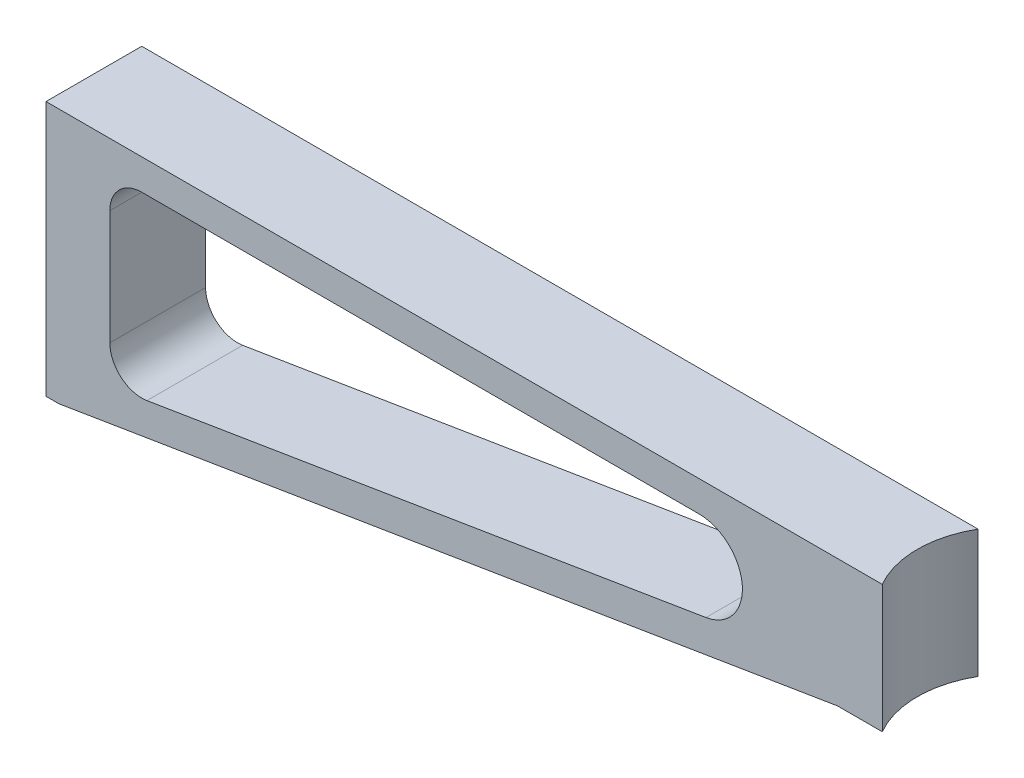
ISO-10303-21;
HEADER;
FILE_DESCRIPTION(('STEP AP214'),'2;1');
FILE_NAME('part.step','',(''),(''),'','','');
FILE_SCHEMA(('AUTOMOTIVE_DESIGN { 1 0 10303 214 1 1 1 1 }'));
ENDSEC;
DATA;
#1=APPLICATION_CONTEXT('core data for automotive mechanical design processes');
#2=APPLICATION_PROTOCOL_DEFINITION('international standard','automotive_design',2000,#1);
#3=PRODUCT_CONTEXT('',#1,'mechanical');
#4=PRODUCT('Part','Part','',(#3));
#5=PRODUCT_RELATED_PRODUCT_CATEGORY('part','',(#4));
#6=PRODUCT_DEFINITION_FORMATION('','',#4);
#7=PRODUCT_DEFINITION_CONTEXT('part definition',#1,'design');
#8=PRODUCT_DEFINITION('design','',#6,#7);
#9=PRODUCT_DEFINITION_SHAPE('','',#8);
#10=(LENGTH_UNIT() NAMED_UNIT(*) SI_UNIT(.MILLI.,.METRE.));
#11=(NAMED_UNIT(*) PLANE_ANGLE_UNIT() SI_UNIT($,.RADIAN.));
#12=(NAMED_UNIT(*) SI_UNIT($,.STERADIAN.) SOLID_ANGLE_UNIT());
#13=UNCERTAINTY_MEASURE_WITH_UNIT(LENGTH_MEASURE(1.E-05),#10,'distance_accuracy_value','');
#14=(GEOMETRIC_REPRESENTATION_CONTEXT(3) GLOBAL_UNCERTAINTY_ASSIGNED_CONTEXT((#13)) GLOBAL_UNIT_ASSIGNED_CONTEXT((#10,
#11,#12)) REPRESENTATION_CONTEXT('',''));
#15=CARTESIAN_POINT('',(0.,0.,0.));
#16=DIRECTION('',(0.,0.,1.));
#17=DIRECTION('',(1.,0.,0.));
#18=AXIS2_PLACEMENT_3D('',#15,#16,#17);
#19=CARTESIAN_POINT('',(0.,0.,4.7625));
#20=DIRECTION('',(0.,0.,1.));
#21=DIRECTION('',(1.,0.,0.));
#22=AXIS2_PLACEMENT_3D('',#19,#20,#21);
#23=PLANE('',#22);
#24=DIRECTION('',(0.,1.,0.));
#25=VECTOR('',#24,1.);
#26=CARTESIAN_POINT('',(-8.24889197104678,-25.4,4.7625));
#27=LINE('',#26,#25);
#28=CARTESIAN_POINT('',(-8.24889197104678,0.,4.7625));
#29=VERTEX_POINT('',#28);
#30=CARTESIAN_POINT('',(-8.24889197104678,-12.7,4.7625));
#31=VERTEX_POINT('',#30);
#32=EDGE_CURVE('E124',#29,#31,#27,.F.);
#33=ORIENTED_EDGE('',*,*,#32,.F.);
#34=DIRECTION('',(-1.,0.,0.));
#35=VECTOR('',#34,1.);
#36=CARTESIAN_POINT('',(0.,0.,4.7625));
#37=LINE('',#36,#35);
#38=CARTESIAN_POINT('',(-91.44,0.,4.7625));
#39=VERTEX_POINT('',#38);
#40=EDGE_CURVE('E132',#29,#39,#37,.T.);
#41=ORIENTED_EDGE('',*,*,#40,.T.);
#42=DIRECTION('',(0.,-1.,0.));
#43=VECTOR('',#42,1.);
#44=CARTESIAN_POINT('',(-91.44,0.,4.7625));
#45=LINE('',#44,#43);
#46=CARTESIAN_POINT('',(-91.44,-25.4,4.7625));
#47=VERTEX_POINT('',#46);
#48=EDGE_CURVE('E142',#39,#47,#45,.T.);
#49=ORIENTED_EDGE('',*,*,#48,.T.);
#50=DIRECTION('',(1.,0.,0.));
#51=VECTOR('',#50,1.);
#52=CARTESIAN_POINT('',(-91.44,-25.4,4.7625));
#53=LINE('',#52,#51);
#54=CARTESIAN_POINT('',(-90.17,-25.4,4.7625));
#55=VERTEX_POINT('',#54);
#56=EDGE_CURVE('E163',#47,#55,#53,.T.);
#57=ORIENTED_EDGE('',*,*,#56,.T.);
#58=DIRECTION('',(0.986827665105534,0.161775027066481,0.));
#59=VECTOR('',#58,1.);
#60=CARTESIAN_POINT('',(-12.7,-12.7,4.7625));
#61=LINE('',#60,#59);
#62=CARTESIAN_POINT('',(-12.7,-12.7,4.7625));
#63=VERTEX_POINT('',#62);
#64=EDGE_CURVE('E146',#55,#63,#61,.T.);
#65=ORIENTED_EDGE('',*,*,#64,.T.);
#66=DIRECTION('',(1.,0.,0.));
#67=VECTOR('',#66,1.);
#68=CARTESIAN_POINT('',(-12.7,-12.7,4.7625));
#69=LINE('',#68,#67);
#70=EDGE_CURVE('E135',#63,#31,#69,.T.);
#71=ORIENTED_EDGE('',*,*,#70,.T.);
#72=EDGE_LOOP('',(#33,#41,#49,#57,#65,#71));
#73=FACE_BOUND('',#72,.T.);
#74=DIRECTION('',(0.,-1.,0.));
#75=VECTOR('',#74,1.);
#76=CARTESIAN_POINT('',(-85.09,-6.22300000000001,4.7625));
#77=LINE('',#76,#75);
#78=CARTESIAN_POINT('',(-85.09,-6.22300000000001,4.7625));
#79=VERTEX_POINT('',#78);
#80=CARTESIAN_POINT('',(-85.0899999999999,-17.6119604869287,4.7625));
#81=VERTEX_POINT('',#80);
#82=EDGE_CURVE('E192',#79,#81,#77,.T.);
#83=ORIENTED_EDGE('',*,*,#82,.F.);
#84=CARTESIAN_POINT('',(-81.915,-6.22300000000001,4.7625));
#85=DIRECTION('',(0.,0.,1.));
#86=DIRECTION('',(-1.,0.,0.));
#87=AXIS2_PLACEMENT_3D('',#84,#85,#86);
#88=CIRCLE('',#87,3.175);
#89=CARTESIAN_POINT('',(-81.915,-3.04800000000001,4.7625));
#90=VERTEX_POINT('',#89);
#91=EDGE_CURVE('E190',#90,#79,#88,.T.);
#92=ORIENTED_EDGE('',*,*,#91,.F.);
#93=DIRECTION('',(-1.,0.,0.));
#94=VECTOR('',#93,1.);
#95=CARTESIAN_POINT('',(-26.4800084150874,-3.048,4.7625));
#96=LINE('',#95,#94);
#97=CARTESIAN_POINT('',(-26.4800084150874,-3.048,4.7625));
#98=VERTEX_POINT('',#97);
#99=EDGE_CURVE('E201',#98,#90,#96,.T.);
#100=ORIENTED_EDGE('',*,*,#99,.F.);
#101=CARTESIAN_POINT('',(-26.4800084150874,-7.366,4.7625));
#102=DIRECTION('',(0.,0.,1.));
#103=DIRECTION('',(1.,0.,0.));
#104=AXIS2_PLACEMENT_3D('',#101,#102,#103);
#105=CIRCLE('',#104,4.318);
#106=CARTESIAN_POINT('',(-25.7814638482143,-11.6271218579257,4.7625));
#107=VERTEX_POINT('',#106);
#108=EDGE_CURVE('E199',#107,#98,#105,.T.);
#109=ORIENTED_EDGE('',*,*,#108,.F.);
#110=DIRECTION('',(0.986827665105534,0.161775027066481,0.));
#111=VECTOR('',#110,1.);
#112=CARTESIAN_POINT('',(-81.4013642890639,-20.7451383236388,4.7625));
#113=LINE('',#112,#111);
#114=CARTESIAN_POINT('',(-81.4013642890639,-20.7451383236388,4.7625));
#115=VERTEX_POINT('',#114);
#116=EDGE_CURVE('E197',#115,#107,#113,.T.);
#117=ORIENTED_EDGE('',*,*,#116,.F.);
#118=CARTESIAN_POINT('',(-81.915,-17.6119604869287,4.7625));
#119=DIRECTION('',(0.,0.,1.));
#120=DIRECTION('',(1.,0.,0.));
#121=AXIS2_PLACEMENT_3D('',#118,#119,#120);
#122=CIRCLE('',#121,3.17499999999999);
#123=EDGE_CURVE('E195',#81,#115,#122,.T.);
#124=ORIENTED_EDGE('',*,*,#123,.F.);
#125=EDGE_LOOP('',(#83,#92,#100,#109,#117,#124));
#126=FACE_BOUND('',#125,.T.);
#127=ADVANCED_FACE('F37',(#73,#126),#23,.T.);
#128=CARTESIAN_POINT('',(0.,0.,-4.7625));
#129=DIRECTION('',(0.,0.,1.));
#130=DIRECTION('',(1.,0.,0.));
#131=AXIS2_PLACEMENT_3D('',#128,#129,#130);
#132=PLANE('',#131);
#133=DIRECTION('',(-1.,0.,0.));
#134=VECTOR('',#133,1.);
#135=CARTESIAN_POINT('',(0.,0.,-4.7625));
#136=LINE('',#135,#134);
#137=CARTESIAN_POINT('',(-8.24889197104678,0.,-4.7625));
#138=VERTEX_POINT('',#137);
#139=CARTESIAN_POINT('',(-91.44,0.,-4.7625));
#140=VERTEX_POINT('',#139);
#141=EDGE_CURVE('E159',#138,#140,#136,.T.);
#142=ORIENTED_EDGE('',*,*,#141,.F.);
#143=DIRECTION('',(0.,1.,0.));
#144=VECTOR('',#143,1.);
#145=CARTESIAN_POINT('',(-8.24889197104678,-25.4,-4.7625));
#146=LINE('',#145,#144);
#147=CARTESIAN_POINT('',(-8.24889197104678,-12.7,-4.7625));
#148=VERTEX_POINT('',#147);
#149=EDGE_CURVE('E52',#138,#148,#146,.F.);
#150=ORIENTED_EDGE('',*,*,#149,.T.);
#151=DIRECTION('',(1.,0.,0.));
#152=VECTOR('',#151,1.);
#153=CARTESIAN_POINT('',(-12.7,-12.7,-4.7625));
#154=LINE('',#153,#152);
#155=CARTESIAN_POINT('',(-12.7,-12.7,-4.7625));
#156=VERTEX_POINT('',#155);
#157=EDGE_CURVE('E156',#156,#148,#154,.T.);
#158=ORIENTED_EDGE('',*,*,#157,.F.);
#159=DIRECTION('',(0.986827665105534,0.161775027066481,0.));
#160=VECTOR('',#159,1.);
#161=CARTESIAN_POINT('',(-12.7,-12.7,-4.7625));
#162=LINE('',#161,#160);
#163=CARTESIAN_POINT('',(-90.17,-25.4,-4.7625));
#164=VERTEX_POINT('',#163);
#165=EDGE_CURVE('E153',#164,#156,#162,.T.);
#166=ORIENTED_EDGE('',*,*,#165,.F.);
#167=DIRECTION('',(1.,0.,0.));
#168=VECTOR('',#167,1.);
#169=CARTESIAN_POINT('',(-91.44,-25.4,-4.7625));
#170=LINE('',#169,#168);
#171=CARTESIAN_POINT('',(-91.44,-25.4,-4.7625));
#172=VERTEX_POINT('',#171);
#173=EDGE_CURVE('E150',#172,#164,#170,.T.);
#174=ORIENTED_EDGE('',*,*,#173,.F.);
#175=DIRECTION('',(0.,-1.,0.));
#176=VECTOR('',#175,1.);
#177=CARTESIAN_POINT('',(-91.44,0.,-4.7625));
#178=LINE('',#177,#176);
#179=EDGE_CURVE('E161',#140,#172,#178,.T.);
#180=ORIENTED_EDGE('',*,*,#179,.F.);
#181=EDGE_LOOP('',(#142,#150,#158,#166,#174,#180));
#182=FACE_BOUND('',#181,.T.);
#183=CARTESIAN_POINT('',(-81.915,-6.22300000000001,-4.7625));
#184=DIRECTION('',(0.,0.,1.));
#185=DIRECTION('',(-1.,0.,0.));
#186=AXIS2_PLACEMENT_3D('',#183,#184,#185);
#187=CIRCLE('',#186,3.175);
#188=CARTESIAN_POINT('',(-81.915,-3.04800000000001,-4.7625));
#189=VERTEX_POINT('',#188);
#190=CARTESIAN_POINT('',(-85.09,-6.22300000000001,-4.7625));
#191=VERTEX_POINT('',#190);
#192=EDGE_CURVE('E136',#189,#191,#187,.T.);
#193=ORIENTED_EDGE('',*,*,#192,.T.);
#194=DIRECTION('',(0.,-1.,0.));
#195=VECTOR('',#194,1.);
#196=CARTESIAN_POINT('',(-85.09,-6.22300000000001,-4.7625));
#197=LINE('',#196,#195);
#198=CARTESIAN_POINT('',(-85.0899999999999,-17.6119604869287,-4.7625));
#199=VERTEX_POINT('',#198);
#200=EDGE_CURVE('E206',#191,#199,#197,.T.);
#201=ORIENTED_EDGE('',*,*,#200,.T.);
#202=CARTESIAN_POINT('',(-81.915,-17.6119604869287,-4.7625));
#203=DIRECTION('',(0.,0.,1.));
#204=DIRECTION('',(1.,0.,0.));
#205=AXIS2_PLACEMENT_3D('',#202,#203,#204);
#206=CIRCLE('',#205,3.17499999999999);
#207=CARTESIAN_POINT('',(-81.4013642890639,-20.7451383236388,-4.7625));
#208=VERTEX_POINT('',#207);
#209=EDGE_CURVE('E209',#199,#208,#206,.T.);
#210=ORIENTED_EDGE('',*,*,#209,.T.);
#211=DIRECTION('',(0.986827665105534,0.161775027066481,0.));
#212=VECTOR('',#211,1.);
#213=CARTESIAN_POINT('',(-81.4013642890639,-20.7451383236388,-4.7625));
#214=LINE('',#213,#212);
#215=CARTESIAN_POINT('',(-25.7814638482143,-11.6271218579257,-4.7625));
#216=VERTEX_POINT('',#215);
#217=EDGE_CURVE('E212',#208,#216,#214,.T.);
#218=ORIENTED_EDGE('',*,*,#217,.T.);
#219=CARTESIAN_POINT('',(-26.4800084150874,-7.366,-4.7625));
#220=DIRECTION('',(0.,0.,1.));
#221=DIRECTION('',(1.,0.,0.));
#222=AXIS2_PLACEMENT_3D('',#219,#220,#221);
#223=CIRCLE('',#222,4.318);
#224=CARTESIAN_POINT('',(-26.4800084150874,-3.048,-4.7625));
#225=VERTEX_POINT('',#224);
#226=EDGE_CURVE('E215',#216,#225,#223,.T.);
#227=ORIENTED_EDGE('',*,*,#226,.T.);
#228=DIRECTION('',(-1.,0.,0.));
#229=VECTOR('',#228,1.);
#230=CARTESIAN_POINT('',(-26.4800084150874,-3.048,-4.7625));
#231=LINE('',#230,#229);
#232=EDGE_CURVE('E193',#225,#189,#231,.T.);
#233=ORIENTED_EDGE('',*,*,#232,.T.);
#234=EDGE_LOOP('',(#193,#201,#210,#218,#227,#233));
#235=FACE_BOUND('',#234,.T.);
#236=ADVANCED_FACE('F181',(#182,#235),#132,.F.);
#237=CARTESIAN_POINT('',(-91.44,-25.4,4.7625));
#238=DIRECTION('',(0.,1.,0.));
#239=DIRECTION('',(0.,0.,1.));
#240=AXIS2_PLACEMENT_3D('',#237,#238,#239);
#241=PLANE('',#240);
#242=ORIENTED_EDGE('',*,*,#173,.T.);
#243=DIRECTION('',(0.,0.,-1.));
#244=VECTOR('',#243,1.);
#245=CARTESIAN_POINT('',(-90.17,-25.4,4.7625));
#246=LINE('',#245,#244);
#247=EDGE_CURVE('E45',#55,#164,#246,.T.);
#248=ORIENTED_EDGE('',*,*,#247,.F.);
#249=ORIENTED_EDGE('',*,*,#56,.F.);
#250=DIRECTION('',(0.,0.,-1.));
#251=VECTOR('',#250,1.);
#252=CARTESIAN_POINT('',(-91.44,-25.4,4.7625));
#253=LINE('',#252,#251);
#254=EDGE_CURVE('E144',#47,#172,#253,.T.);
#255=ORIENTED_EDGE('',*,*,#254,.T.);
#256=EDGE_LOOP('',(#242,#248,#249,#255));
#257=FACE_BOUND('',#256,.T.);
#258=ADVANCED_FACE('F39',(#257),#241,.F.);
#259=CARTESIAN_POINT('',(-12.7,-12.7,4.7625));
#260=DIRECTION('',(-0.161775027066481,0.986827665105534,0.));
#261=DIRECTION('',(-0.986827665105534,-0.161775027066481,0.));
#262=AXIS2_PLACEMENT_3D('',#259,#260,#261);
#263=PLANE('',#262);
#264=ORIENTED_EDGE('',*,*,#165,.T.);
#265=DIRECTION('',(0.,0.,-1.));
#266=VECTOR('',#265,1.);
#267=CARTESIAN_POINT('',(-12.7,-12.7,4.7625));
#268=LINE('',#267,#266);
#269=EDGE_CURVE('E167',#63,#156,#268,.T.);
#270=ORIENTED_EDGE('',*,*,#269,.F.);
#271=ORIENTED_EDGE('',*,*,#64,.F.);
#272=ORIENTED_EDGE('',*,*,#247,.T.);
#273=EDGE_LOOP('',(#264,#270,#271,#272));
#274=FACE_BOUND('',#273,.T.);
#275=ADVANCED_FACE('F172',(#274),#263,.F.);
#276=CARTESIAN_POINT('',(-12.7,-12.7,4.7625));
#277=DIRECTION('',(0.,1.,0.));
#278=DIRECTION('',(0.,0.,1.));
#279=AXIS2_PLACEMENT_3D('',#276,#277,#278);
#280=PLANE('',#279);
#281=ORIENTED_EDGE('',*,*,#157,.T.);
#282=CARTESIAN_POINT('',(0.,-12.7,0.));
#283=DIRECTION('',(0.,1.,0.));
#284=DIRECTION('',(0.,0.,1.));
#285=AXIS2_PLACEMENT_3D('',#282,#283,#284);
#286=CIRCLE('',#285,9.525);
#287=EDGE_CURVE('E186',#148,#31,#286,.T.);
#288=ORIENTED_EDGE('',*,*,#287,.T.);
#289=ORIENTED_EDGE('',*,*,#70,.F.);
#290=ORIENTED_EDGE('',*,*,#269,.T.);
#291=EDGE_LOOP('',(#281,#288,#289,#290));
#292=FACE_BOUND('',#291,.T.);
#293=ADVANCED_FACE('F185',(#292),#280,.F.);
#294=CARTESIAN_POINT('',(0.,0.,4.7625));
#295=DIRECTION('',(0.,-1.,0.));
#296=DIRECTION('',(1.,0.,0.));
#297=AXIS2_PLACEMENT_3D('',#294,#295,#296);
#298=PLANE('',#297);
#299=ORIENTED_EDGE('',*,*,#40,.F.);
#300=CARTESIAN_POINT('',(0.,0.,0.));
#301=DIRECTION('',(0.,-1.,0.));
#302=DIRECTION('',(1.,0.,0.));
#303=AXIS2_PLACEMENT_3D('',#300,#301,#302);
#304=CIRCLE('',#303,9.525);
#305=EDGE_CURVE('E11',#29,#138,#304,.T.);
#306=ORIENTED_EDGE('',*,*,#305,.T.);
#307=ORIENTED_EDGE('',*,*,#141,.T.);
#308=DIRECTION('',(0.,0.,-1.));
#309=VECTOR('',#308,1.);
#310=CARTESIAN_POINT('',(-91.44,0.,4.7625));
#311=LINE('',#310,#309);
#312=EDGE_CURVE('E140',#39,#140,#311,.T.);
#313=ORIENTED_EDGE('',*,*,#312,.F.);
#314=EDGE_LOOP('',(#299,#306,#307,#313));
#315=FACE_BOUND('',#314,.T.);
#316=ADVANCED_FACE('F138',(#315),#298,.F.);
#317=CARTESIAN_POINT('',(-91.44,0.,4.7625));
#318=DIRECTION('',(1.,0.,0.));
#319=DIRECTION('',(0.,0.,-1.));
#320=AXIS2_PLACEMENT_3D('',#317,#318,#319);
#321=PLANE('',#320);
#322=ORIENTED_EDGE('',*,*,#179,.T.);
#323=ORIENTED_EDGE('',*,*,#254,.F.);
#324=ORIENTED_EDGE('',*,*,#48,.F.);
#325=ORIENTED_EDGE('',*,*,#312,.T.);
#326=EDGE_LOOP('',(#322,#323,#324,#325));
#327=FACE_BOUND('',#326,.T.);
#328=ADVANCED_FACE('F232',(#327),#321,.F.);
#329=CARTESIAN_POINT('',(-81.915,-6.22300000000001,4.7625));
#330=DIRECTION('',(0.,0.,-1.));
#331=DIRECTION('',(-1.,0.,0.));
#332=AXIS2_PLACEMENT_3D('',#329,#330,#331);
#333=CYLINDRICAL_SURFACE('',#332,3.175);
#334=ORIENTED_EDGE('',*,*,#192,.F.);
#335=DIRECTION('',(0.,0.,-1.));
#336=VECTOR('',#335,1.);
#337=CARTESIAN_POINT('',(-81.915,-3.04800000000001,4.7625));
#338=LINE('',#337,#336);
#339=EDGE_CURVE('E203',#90,#189,#338,.T.);
#340=ORIENTED_EDGE('',*,*,#339,.F.);
#341=ORIENTED_EDGE('',*,*,#91,.T.);
#342=DIRECTION('',(0.,0.,-1.));
#343=VECTOR('',#342,1.);
#344=CARTESIAN_POINT('',(-85.09,-6.22300000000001,4.7625));
#345=LINE('',#344,#343);
#346=EDGE_CURVE('E154',#79,#191,#345,.T.);
#347=ORIENTED_EDGE('',*,*,#346,.T.);
#348=EDGE_LOOP('',(#334,#340,#341,#347));
#349=FACE_BOUND('',#348,.T.);
#350=ADVANCED_FACE('F234',(#349),#333,.F.);
#351=CARTESIAN_POINT('',(-85.09,-6.22300000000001,4.7625));
#352=DIRECTION('',(1.,0.,0.));
#353=DIRECTION('',(0.,1.,0.));
#354=AXIS2_PLACEMENT_3D('',#351,#352,#353);
#355=PLANE('',#354);
#356=ORIENTED_EDGE('',*,*,#200,.F.);
#357=ORIENTED_EDGE('',*,*,#346,.F.);
#358=ORIENTED_EDGE('',*,*,#82,.T.);
#359=DIRECTION('',(0.,0.,-1.));
#360=VECTOR('',#359,1.);
#361=CARTESIAN_POINT('',(-85.0899999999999,-17.6119604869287,4.7625));
#362=LINE('',#361,#360);
#363=EDGE_CURVE('E227',#81,#199,#362,.T.);
#364=ORIENTED_EDGE('',*,*,#363,.T.);
#365=EDGE_LOOP('',(#356,#357,#358,#364));
#366=FACE_BOUND('',#365,.T.);
#367=ADVANCED_FACE('F240',(#366),#355,.T.);
#368=CARTESIAN_POINT('',(-81.915,-17.6119604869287,4.7625));
#369=DIRECTION('',(0.,0.,-1.));
#370=DIRECTION('',(-1.,0.,0.));
#371=AXIS2_PLACEMENT_3D('',#368,#369,#370);
#372=CYLINDRICAL_SURFACE('',#371,3.17499999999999);
#373=ORIENTED_EDGE('',*,*,#209,.F.);
#374=ORIENTED_EDGE('',*,*,#363,.F.);
#375=ORIENTED_EDGE('',*,*,#123,.T.);
#376=DIRECTION('',(0.,0.,-1.));
#377=VECTOR('',#376,1.);
#378=CARTESIAN_POINT('',(-81.4013642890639,-20.7451383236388,4.7625));
#379=LINE('',#378,#377);
#380=EDGE_CURVE('E225',#115,#208,#379,.T.);
#381=ORIENTED_EDGE('',*,*,#380,.T.);
#382=EDGE_LOOP('',(#373,#374,#375,#381));
#383=FACE_BOUND('',#382,.T.);
#384=ADVANCED_FACE('F253',(#383),#372,.F.);
#385=CARTESIAN_POINT('',(-81.4013642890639,-20.7451383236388,4.7625));
#386=DIRECTION('',(-0.161775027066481,0.986827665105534,0.));
#387=DIRECTION('',(-0.986827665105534,-0.161775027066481,0.));
#388=AXIS2_PLACEMENT_3D('',#385,#386,#387);
#389=PLANE('',#388);
#390=ORIENTED_EDGE('',*,*,#217,.F.);
#391=ORIENTED_EDGE('',*,*,#380,.F.);
#392=ORIENTED_EDGE('',*,*,#116,.T.);
#393=DIRECTION('',(0.,0.,-1.));
#394=VECTOR('',#393,1.);
#395=CARTESIAN_POINT('',(-25.7814638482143,-11.6271218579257,4.7625));
#396=LINE('',#395,#394);
#397=EDGE_CURVE('E223',#107,#216,#396,.T.);
#398=ORIENTED_EDGE('',*,*,#397,.T.);
#399=EDGE_LOOP('',(#390,#391,#392,#398));
#400=FACE_BOUND('',#399,.T.);
#401=ADVANCED_FACE('F257',(#400),#389,.T.);
#402=CARTESIAN_POINT('',(-26.4800084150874,-7.366,4.7625));
#403=DIRECTION('',(0.,0.,-1.));
#404=DIRECTION('',(-1.,0.,0.));
#405=AXIS2_PLACEMENT_3D('',#402,#403,#404);
#406=CYLINDRICAL_SURFACE('',#405,4.318);
#407=ORIENTED_EDGE('',*,*,#226,.F.);
#408=ORIENTED_EDGE('',*,*,#397,.F.);
#409=ORIENTED_EDGE('',*,*,#108,.T.);
#410=DIRECTION('',(0.,0.,-1.));
#411=VECTOR('',#410,1.);
#412=CARTESIAN_POINT('',(-26.4800084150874,-3.048,4.7625));
#413=LINE('',#412,#411);
#414=EDGE_CURVE('E59',#98,#225,#413,.T.);
#415=ORIENTED_EDGE('',*,*,#414,.T.);
#416=EDGE_LOOP('',(#407,#408,#409,#415));
#417=FACE_BOUND('',#416,.T.);
#418=ADVANCED_FACE('F261',(#417),#406,.F.);
#419=CARTESIAN_POINT('',(-26.4800084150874,-3.048,4.7625));
#420=DIRECTION('',(0.,-1.,0.));
#421=DIRECTION('',(1.,0.,0.));
#422=AXIS2_PLACEMENT_3D('',#419,#420,#421);
#423=PLANE('',#422);
#424=ORIENTED_EDGE('',*,*,#232,.F.);
#425=ORIENTED_EDGE('',*,*,#414,.F.);
#426=ORIENTED_EDGE('',*,*,#99,.T.);
#427=ORIENTED_EDGE('',*,*,#339,.T.);
#428=EDGE_LOOP('',(#424,#425,#426,#427));
#429=FACE_BOUND('',#428,.T.);
#430=ADVANCED_FACE('F265',(#429),#423,.T.);
#431=CARTESIAN_POINT('',(0.,-25.4,0.));
#432=DIRECTION('',(0.,1.,0.));
#433=DIRECTION('',(-1.,0.,0.));
#434=AXIS2_PLACEMENT_3D('',#431,#432,#433);
#435=CYLINDRICAL_SURFACE('',#434,9.525);
#436=ORIENTED_EDGE('',*,*,#32,.T.);
#437=ORIENTED_EDGE('',*,*,#287,.F.);
#438=ORIENTED_EDGE('',*,*,#149,.F.);
#439=ORIENTED_EDGE('',*,*,#305,.F.);
#440=EDGE_LOOP('',(#436,#437,#438,#439));
#441=FACE_BOUND('',#440,.T.);
#442=ADVANCED_FACE('F123',(#441),#435,.F.);
#443=CLOSED_SHELL('',(#127,#236,#258,#275,#293,#316,#328,#350,#367,#384,#401,#418,#430,#442));
#444=MANIFOLD_SOLID_BREP('B2',#443);
#445=ADVANCED_BREP_SHAPE_REPRESENTATION('',(#18,#444),#14);
#446=SHAPE_DEFINITION_REPRESENTATION(#9,#445);
ENDSEC;
END-ISO-10303-21;
